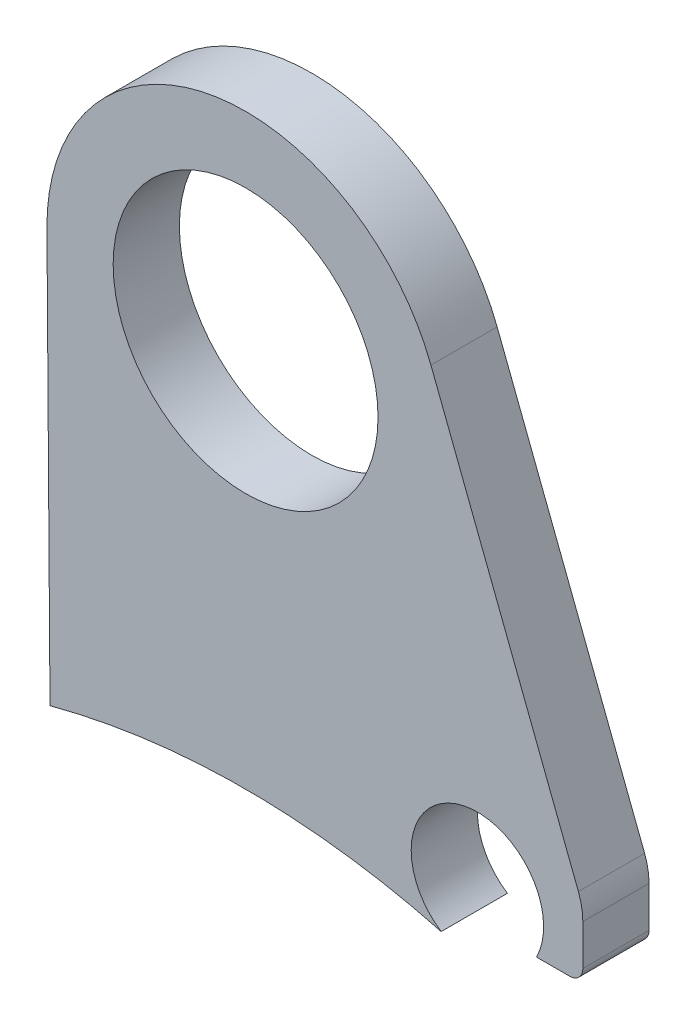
ISO-10303-21;
HEADER;
FILE_DESCRIPTION(('STEP AP214'),'2;1');
FILE_NAME('part.step','',(''),(''),'','','');
FILE_SCHEMA(('AUTOMOTIVE_DESIGN { 1 0 10303 214 1 1 1 1 }'));
ENDSEC;
DATA;
#1=APPLICATION_CONTEXT('core data for automotive mechanical design processes');
#2=APPLICATION_PROTOCOL_DEFINITION('international standard','automotive_design',2000,#1);
#3=PRODUCT_CONTEXT('',#1,'mechanical');
#4=PRODUCT('Part','Part','',(#3));
#5=PRODUCT_RELATED_PRODUCT_CATEGORY('part','',(#4));
#6=PRODUCT_DEFINITION_FORMATION('','',#4);
#7=PRODUCT_DEFINITION_CONTEXT('part definition',#1,'design');
#8=PRODUCT_DEFINITION('design','',#6,#7);
#9=PRODUCT_DEFINITION_SHAPE('','',#8);
#10=(LENGTH_UNIT() NAMED_UNIT(*) SI_UNIT(.MILLI.,.METRE.));
#11=(NAMED_UNIT(*) PLANE_ANGLE_UNIT() SI_UNIT($,.RADIAN.));
#12=(NAMED_UNIT(*) SI_UNIT($,.STERADIAN.) SOLID_ANGLE_UNIT());
#13=UNCERTAINTY_MEASURE_WITH_UNIT(LENGTH_MEASURE(1.E-05),#10,'distance_accuracy_value','');
#14=(GEOMETRIC_REPRESENTATION_CONTEXT(3) GLOBAL_UNCERTAINTY_ASSIGNED_CONTEXT((#13)) GLOBAL_UNIT_ASSIGNED_CONTEXT((#10,
#11,#12)) REPRESENTATION_CONTEXT('',''));
#15=CARTESIAN_POINT('',(0.,0.,0.));
#16=DIRECTION('',(0.,0.,1.));
#17=DIRECTION('',(1.,0.,0.));
#18=AXIS2_PLACEMENT_3D('',#15,#16,#17);
#19=CARTESIAN_POINT('',(2.61766075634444,3.42838590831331,1.));
#20=DIRECTION('',(0.,0.,1.));
#21=DIRECTION('',(1.,0.,0.));
#22=AXIS2_PLACEMENT_3D('',#19,#20,#21);
#23=PLANE('',#22);
#24=DIRECTION('',(1.,0.,0.));
#25=VECTOR('',#24,1.);
#26=CARTESIAN_POINT('',(7.01057399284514,-2.43678106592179,1.));
#27=LINE('',#26,#25);
#28=CARTESIAN_POINT('',(7.01057399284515,-2.43678106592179,1.));
#29=VERTEX_POINT('',#28);
#30=CARTESIAN_POINT('',(7.51057399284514,-2.43678106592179,1.));
#31=VERTEX_POINT('',#30);
#32=EDGE_CURVE('E189',#29,#31,#27,.T.);
#33=ORIENTED_EDGE('',*,*,#32,.T.);
#34=CARTESIAN_POINT('',(7.51057399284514,-2.23678106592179,1.));
#35=DIRECTION('',(0.,0.,1.));
#36=DIRECTION('',(1.,0.,0.));
#37=AXIS2_PLACEMENT_3D('',#34,#35,#36);
#38=CIRCLE('',#37,0.2);
#39=CARTESIAN_POINT('',(7.71057399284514,-2.23678106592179,1.));
#40=VERTEX_POINT('',#39);
#41=EDGE_CURVE('E11',#31,#40,#38,.T.);
#42=ORIENTED_EDGE('',*,*,#41,.T.);
#43=DIRECTION('',(0.,1.,0.));
#44=VECTOR('',#43,1.);
#45=CARTESIAN_POINT('',(7.71057399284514,-2.43678106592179,1.));
#46=LINE('',#45,#44);
#47=CARTESIAN_POINT('',(7.71057399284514,-1.62302345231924,1.));
#48=VERTEX_POINT('',#47);
#49=EDGE_CURVE('E152',#40,#48,#46,.T.);
#50=ORIENTED_EDGE('',*,*,#49,.T.);
#51=CARTESIAN_POINT('',(6.71057399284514,-1.62302345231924,1.));
#52=DIRECTION('',(0.,0.,1.));
#53=DIRECTION('',(1.,0.,0.));
#54=AXIS2_PLACEMENT_3D('',#51,#52,#53);
#55=CIRCLE('',#54,1.);
#56=CARTESIAN_POINT('',(7.64352714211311,-1.2630256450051,1.));
#57=VERTEX_POINT('',#56);
#58=EDGE_CURVE('E142',#48,#57,#55,.T.);
#59=ORIENTED_EDGE('',*,*,#58,.T.);
#60=DIRECTION('',(-0.359997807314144,0.932953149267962,0.));
#61=VECTOR('',#60,1.);
#62=CARTESIAN_POINT('',(7.71057399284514,-1.43678106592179,1.));
#63=LINE('',#62,#61);
#64=CARTESIAN_POINT('',(5.41652020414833,4.50837933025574,1.));
#65=VERTEX_POINT('',#64);
#66=EDGE_CURVE('E119',#57,#65,#63,.T.);
#67=ORIENTED_EDGE('',*,*,#66,.T.);
#68=CARTESIAN_POINT('',(2.61766075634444,3.42838590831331,1.));
#69=DIRECTION('',(0.,0.,1.));
#70=DIRECTION('',(1.,0.,0.));
#71=AXIS2_PLACEMENT_3D('',#68,#69,#70);
#72=CIRCLE('',#71,3.);
#73=CARTESIAN_POINT('',(-0.382256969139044,3.40616789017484,1.));
#74=VERTEX_POINT('',#73);
#75=EDGE_CURVE('E114',#65,#74,#72,.T.);
#76=ORIENTED_EDGE('',*,*,#75,.T.);
#77=DIRECTION('',(0.00740600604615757,-0.999972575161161,0.));
#78=VECTOR('',#77,1.);
#79=CARTESIAN_POINT('',(-0.382256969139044,3.40616789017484,1.));
#80=LINE('',#79,#78);
#81=CARTESIAN_POINT('',(-0.336125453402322,-2.82259431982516,1.));
#82=VERTEX_POINT('',#81);
#83=EDGE_CURVE('E103',#74,#82,#80,.T.);
#84=ORIENTED_EDGE('',*,*,#83,.T.);
#85=CARTESIAN_POINT('',(2.61766075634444,-13.9367810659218,1.));
#86=DIRECTION('',(0.,0.,-1.));
#87=DIRECTION('',(-1.,0.,0.));
#88=AXIS2_PLACEMENT_3D('',#85,#86,#87);
#89=CIRCLE('',#88,11.5);
#90=CARTESIAN_POINT('',(5.57144696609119,-2.82259431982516,1.));
#91=VERTEX_POINT('',#90);
#92=EDGE_CURVE('E113',#82,#91,#89,.T.);
#93=ORIENTED_EDGE('',*,*,#92,.T.);
#94=CARTESIAN_POINT('',(6.11826997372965,-1.9853460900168,1.));
#95=DIRECTION('',(0.,0.,-1.));
#96=DIRECTION('',(-1.,0.,0.));
#97=AXIS2_PLACEMENT_3D('',#94,#95,#96);
#98=CIRCLE('',#97,1.);
#99=EDGE_CURVE('E177',#91,#29,#98,.T.);
#100=ORIENTED_EDGE('',*,*,#99,.T.);
#101=EDGE_LOOP('',(#33,#42,#50,#59,#67,#76,#84,#93,#100));
#102=FACE_BOUND('',#101,.T.);
#103=CARTESIAN_POINT('',(2.61766075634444,3.42838590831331,1.));
#104=DIRECTION('',(0.,0.,1.));
#105=DIRECTION('',(1.,0.,0.));
#106=AXIS2_PLACEMENT_3D('',#103,#104,#105);
#107=CIRCLE('',#106,2.);
#108=CARTESIAN_POINT('',(4.61766075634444,3.42838590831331,1.));
#109=VERTEX_POINT('',#108);
#110=EDGE_CURVE('E186',#109,#109,#107,.T.);
#111=ORIENTED_EDGE('',*,*,#110,.F.);
#112=EDGE_LOOP('',(#111));
#113=FACE_BOUND('',#112,.T.);
#114=ADVANCED_FACE('F32',(#102,#113),#23,.T.);
#115=CARTESIAN_POINT('',(2.61766075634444,3.42838590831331,0.));
#116=DIRECTION('',(0.,0.,1.));
#117=DIRECTION('',(1.,0.,0.));
#118=AXIS2_PLACEMENT_3D('',#115,#116,#117);
#119=PLANE('',#118);
#120=DIRECTION('',(0.,1.,0.));
#121=VECTOR('',#120,1.);
#122=CARTESIAN_POINT('',(7.71057399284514,-2.43678106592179,0.));
#123=LINE('',#122,#121);
#124=CARTESIAN_POINT('',(7.71057399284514,-2.23678106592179,0.));
#125=VERTEX_POINT('',#124);
#126=CARTESIAN_POINT('',(7.71057399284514,-1.62302345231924,0.));
#127=VERTEX_POINT('',#126);
#128=EDGE_CURVE('E151',#125,#127,#123,.T.);
#129=ORIENTED_EDGE('',*,*,#128,.F.);
#130=CARTESIAN_POINT('',(7.51057399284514,-2.23678106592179,0.));
#131=DIRECTION('',(0.,0.,1.));
#132=DIRECTION('',(1.,0.,0.));
#133=AXIS2_PLACEMENT_3D('',#130,#131,#132);
#134=CIRCLE('',#133,0.2);
#135=CARTESIAN_POINT('',(7.51057399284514,-2.43678106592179,0.));
#136=VERTEX_POINT('',#135);
#137=EDGE_CURVE('E54',#125,#136,#134,.F.);
#138=ORIENTED_EDGE('',*,*,#137,.T.);
#139=DIRECTION('',(1.,0.,0.));
#140=VECTOR('',#139,1.);
#141=CARTESIAN_POINT('',(7.01057399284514,-2.43678106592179,0.));
#142=LINE('',#141,#140);
#143=CARTESIAN_POINT('',(7.01057399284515,-2.43678106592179,0.));
#144=VERTEX_POINT('',#143);
#145=EDGE_CURVE('E159',#144,#136,#142,.T.);
#146=ORIENTED_EDGE('',*,*,#145,.F.);
#147=CARTESIAN_POINT('',(6.11826997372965,-1.9853460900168,0.));
#148=DIRECTION('',(0.,0.,-1.));
#149=DIRECTION('',(-1.,0.,0.));
#150=AXIS2_PLACEMENT_3D('',#147,#148,#149);
#151=CIRCLE('',#150,1.);
#152=CARTESIAN_POINT('',(5.57144696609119,-2.82259431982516,0.));
#153=VERTEX_POINT('',#152);
#154=EDGE_CURVE('E162',#153,#144,#151,.T.);
#155=ORIENTED_EDGE('',*,*,#154,.F.);
#156=CARTESIAN_POINT('',(2.61766075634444,-13.9367810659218,0.));
#157=DIRECTION('',(0.,0.,-1.));
#158=DIRECTION('',(-1.,0.,0.));
#159=AXIS2_PLACEMENT_3D('',#156,#157,#158);
#160=CIRCLE('',#159,11.5);
#161=CARTESIAN_POINT('',(-0.336125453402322,-2.82259431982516,0.));
#162=VERTEX_POINT('',#161);
#163=EDGE_CURVE('E180',#162,#153,#160,.T.);
#164=ORIENTED_EDGE('',*,*,#163,.F.);
#165=DIRECTION('',(0.00740600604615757,-0.999972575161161,0.));
#166=VECTOR('',#165,1.);
#167=CARTESIAN_POINT('',(-0.382256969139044,3.40616789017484,0.));
#168=LINE('',#167,#166);
#169=CARTESIAN_POINT('',(-0.382256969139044,3.40616789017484,0.));
#170=VERTEX_POINT('',#169);
#171=EDGE_CURVE('E181',#170,#162,#168,.T.);
#172=ORIENTED_EDGE('',*,*,#171,.F.);
#173=CARTESIAN_POINT('',(2.61766075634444,3.42838590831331,0.));
#174=DIRECTION('',(0.,0.,1.));
#175=DIRECTION('',(1.,0.,0.));
#176=AXIS2_PLACEMENT_3D('',#173,#174,#175);
#177=CIRCLE('',#176,3.);
#178=CARTESIAN_POINT('',(5.41652020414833,4.50837933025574,0.));
#179=VERTEX_POINT('',#178);
#180=EDGE_CURVE('E127',#179,#170,#177,.T.);
#181=ORIENTED_EDGE('',*,*,#180,.F.);
#182=DIRECTION('',(-0.359997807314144,0.932953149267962,0.));
#183=VECTOR('',#182,1.);
#184=CARTESIAN_POINT('',(7.71057399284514,-1.43678106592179,0.));
#185=LINE('',#184,#183);
#186=CARTESIAN_POINT('',(7.64352714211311,-1.2630256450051,0.));
#187=VERTEX_POINT('',#186);
#188=EDGE_CURVE('E123',#187,#179,#185,.T.);
#189=ORIENTED_EDGE('',*,*,#188,.F.);
#190=CARTESIAN_POINT('',(6.71057399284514,-1.62302345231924,0.));
#191=DIRECTION('',(0.,0.,1.));
#192=DIRECTION('',(1.,0.,0.));
#193=AXIS2_PLACEMENT_3D('',#190,#191,#192);
#194=CIRCLE('',#193,1.);
#195=EDGE_CURVE('E131',#187,#127,#194,.F.);
#196=ORIENTED_EDGE('',*,*,#195,.T.);
#197=EDGE_LOOP('',(#129,#138,#146,#155,#164,#172,#181,#189,#196));
#198=FACE_BOUND('',#197,.T.);
#199=CARTESIAN_POINT('',(2.61766075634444,3.42838590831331,0.));
#200=DIRECTION('',(0.,0.,1.));
#201=DIRECTION('',(1.,0.,0.));
#202=AXIS2_PLACEMENT_3D('',#199,#200,#201);
#203=CIRCLE('',#202,2.);
#204=CARTESIAN_POINT('',(4.61766075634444,3.42838590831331,0.));
#205=VERTEX_POINT('',#204);
#206=EDGE_CURVE('E193',#205,#205,#203,.T.);
#207=ORIENTED_EDGE('',*,*,#206,.T.);
#208=EDGE_LOOP('',(#207));
#209=FACE_BOUND('',#208,.T.);
#210=ADVANCED_FACE('F155',(#198,#209),#119,.F.);
#211=CARTESIAN_POINT('',(2.61766075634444,3.42838590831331,1.));
#212=DIRECTION('',(0.,0.,-1.));
#213=DIRECTION('',(-1.,0.,0.));
#214=AXIS2_PLACEMENT_3D('',#211,#212,#213);
#215=CYLINDRICAL_SURFACE('',#214,3.);
#216=ORIENTED_EDGE('',*,*,#180,.T.);
#217=DIRECTION('',(0.,0.,-1.));
#218=VECTOR('',#217,1.);
#219=CARTESIAN_POINT('',(-0.382256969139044,3.40616789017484,1.));
#220=LINE('',#219,#218);
#221=EDGE_CURVE('E107',#74,#170,#220,.T.);
#222=ORIENTED_EDGE('',*,*,#221,.F.);
#223=ORIENTED_EDGE('',*,*,#75,.F.);
#224=DIRECTION('',(0.,0.,-1.));
#225=VECTOR('',#224,1.);
#226=CARTESIAN_POINT('',(5.41652020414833,4.50837933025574,1.));
#227=LINE('',#226,#225);
#228=EDGE_CURVE('E166',#65,#179,#227,.T.);
#229=ORIENTED_EDGE('',*,*,#228,.T.);
#230=EDGE_LOOP('',(#216,#222,#223,#229));
#231=FACE_BOUND('',#230,.T.);
#232=ADVANCED_FACE('F125',(#231),#215,.T.);
#233=CARTESIAN_POINT('',(-0.382256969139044,3.40616789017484,1.));
#234=DIRECTION('',(0.999972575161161,0.00740600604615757,0.));
#235=DIRECTION('',(-0.00740600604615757,0.999972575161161,0.));
#236=AXIS2_PLACEMENT_3D('',#233,#234,#235);
#237=PLANE('',#236);
#238=ORIENTED_EDGE('',*,*,#171,.T.);
#239=DIRECTION('',(0.,0.,-1.));
#240=VECTOR('',#239,1.);
#241=CARTESIAN_POINT('',(-0.336125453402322,-2.82259431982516,1.));
#242=LINE('',#241,#240);
#243=EDGE_CURVE('E110',#82,#162,#242,.T.);
#244=ORIENTED_EDGE('',*,*,#243,.F.);
#245=ORIENTED_EDGE('',*,*,#83,.F.);
#246=ORIENTED_EDGE('',*,*,#221,.T.);
#247=EDGE_LOOP('',(#238,#244,#245,#246));
#248=FACE_BOUND('',#247,.T.);
#249=ADVANCED_FACE('F105',(#248),#237,.F.);
#250=CARTESIAN_POINT('',(2.61766075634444,-13.9367810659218,1.));
#251=DIRECTION('',(0.,0.,-1.));
#252=DIRECTION('',(-1.,0.,0.));
#253=AXIS2_PLACEMENT_3D('',#250,#251,#252);
#254=CYLINDRICAL_SURFACE('',#253,11.5);
#255=ORIENTED_EDGE('',*,*,#163,.T.);
#256=DIRECTION('',(0.,0.,-1.));
#257=VECTOR('',#256,1.);
#258=CARTESIAN_POINT('',(5.57144696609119,-2.82259431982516,1.));
#259=LINE('',#258,#257);
#260=EDGE_CURVE('E133',#91,#153,#259,.T.);
#261=ORIENTED_EDGE('',*,*,#260,.F.);
#262=ORIENTED_EDGE('',*,*,#92,.F.);
#263=ORIENTED_EDGE('',*,*,#243,.T.);
#264=EDGE_LOOP('',(#255,#261,#262,#263));
#265=FACE_BOUND('',#264,.T.);
#266=ADVANCED_FACE('F220',(#265),#254,.F.);
#267=CARTESIAN_POINT('',(6.11826997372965,-1.9853460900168,1.));
#268=DIRECTION('',(0.,0.,-1.));
#269=DIRECTION('',(-1.,0.,0.));
#270=AXIS2_PLACEMENT_3D('',#267,#268,#269);
#271=CYLINDRICAL_SURFACE('',#270,1.);
#272=ORIENTED_EDGE('',*,*,#154,.T.);
#273=DIRECTION('',(0.,0.,-1.));
#274=VECTOR('',#273,1.);
#275=CARTESIAN_POINT('',(7.01057399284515,-2.43678106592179,1.));
#276=LINE('',#275,#274);
#277=EDGE_CURVE('E168',#29,#144,#276,.T.);
#278=ORIENTED_EDGE('',*,*,#277,.F.);
#279=ORIENTED_EDGE('',*,*,#99,.F.);
#280=ORIENTED_EDGE('',*,*,#260,.T.);
#281=EDGE_LOOP('',(#272,#278,#279,#280));
#282=FACE_BOUND('',#281,.T.);
#283=ADVANCED_FACE('F175',(#282),#271,.F.);
#284=CARTESIAN_POINT('',(7.01057399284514,-2.43678106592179,1.));
#285=DIRECTION('',(0.,1.,0.));
#286=DIRECTION('',(0.,0.,1.));
#287=AXIS2_PLACEMENT_3D('',#284,#285,#286);
#288=PLANE('',#287);
#289=ORIENTED_EDGE('',*,*,#145,.T.);
#290=DIRECTION('',(0.,0.,-1.));
#291=VECTOR('',#290,1.);
#292=CARTESIAN_POINT('',(7.51057399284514,-2.43678106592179,1.));
#293=LINE('',#292,#291);
#294=EDGE_CURVE('E40',#136,#31,#293,.F.);
#295=ORIENTED_EDGE('',*,*,#294,.T.);
#296=ORIENTED_EDGE('',*,*,#32,.F.);
#297=ORIENTED_EDGE('',*,*,#277,.T.);
#298=EDGE_LOOP('',(#289,#295,#296,#297));
#299=FACE_BOUND('',#298,.T.);
#300=ADVANCED_FACE('F215',(#299),#288,.F.);
#301=CARTESIAN_POINT('',(7.71057399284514,-2.43678106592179,1.));
#302=DIRECTION('',(-1.,0.,0.));
#303=DIRECTION('',(0.,0.,1.));
#304=AXIS2_PLACEMENT_3D('',#301,#302,#303);
#305=PLANE('',#304);
#306=ORIENTED_EDGE('',*,*,#49,.F.);
#307=DIRECTION('',(0.,0.,-1.));
#308=VECTOR('',#307,1.);
#309=CARTESIAN_POINT('',(7.71057399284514,-2.23678106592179,1.));
#310=LINE('',#309,#308);
#311=EDGE_CURVE('E144',#40,#125,#310,.T.);
#312=ORIENTED_EDGE('',*,*,#311,.T.);
#313=ORIENTED_EDGE('',*,*,#128,.T.);
#314=DIRECTION('',(0.,0.,-1.));
#315=VECTOR('',#314,1.);
#316=CARTESIAN_POINT('',(7.71057399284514,-1.62302345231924,1.));
#317=LINE('',#316,#315);
#318=EDGE_CURVE('E139',#127,#48,#317,.F.);
#319=ORIENTED_EDGE('',*,*,#318,.T.);
#320=EDGE_LOOP('',(#306,#312,#313,#319));
#321=FACE_BOUND('',#320,.T.);
#322=ADVANCED_FACE('F150',(#321),#305,.F.);
#323=CARTESIAN_POINT('',(7.71057399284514,-1.43678106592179,1.));
#324=DIRECTION('',(-0.932953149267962,-0.359997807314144,0.));
#325=DIRECTION('',(0.359997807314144,-0.932953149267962,0.));
#326=AXIS2_PLACEMENT_3D('',#323,#324,#325);
#327=PLANE('',#326);
#328=ORIENTED_EDGE('',*,*,#66,.F.);
#329=DIRECTION('',(0.,0.,-1.));
#330=VECTOR('',#329,1.);
#331=CARTESIAN_POINT('',(7.64352714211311,-1.2630256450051,1.));
#332=LINE('',#331,#330);
#333=EDGE_CURVE('E128',#57,#187,#332,.T.);
#334=ORIENTED_EDGE('',*,*,#333,.T.);
#335=ORIENTED_EDGE('',*,*,#188,.T.);
#336=ORIENTED_EDGE('',*,*,#228,.F.);
#337=EDGE_LOOP('',(#328,#334,#335,#336));
#338=FACE_BOUND('',#337,.T.);
#339=ADVANCED_FACE('F209',(#338),#327,.F.);
#340=CARTESIAN_POINT('',(2.61766075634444,3.42838590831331,1.));
#341=DIRECTION('',(0.,0.,-1.));
#342=DIRECTION('',(-1.,0.,0.));
#343=AXIS2_PLACEMENT_3D('',#340,#341,#342);
#344=CYLINDRICAL_SURFACE('',#343,2.);
#345=ORIENTED_EDGE('',*,*,#110,.T.);
#346=EDGE_LOOP('',(#345));
#347=FACE_BOUND('',#346,.T.);
#348=ORIENTED_EDGE('',*,*,#206,.F.);
#349=EDGE_LOOP('',(#348));
#350=FACE_BOUND('',#349,.T.);
#351=ADVANCED_FACE('F199',(#347,#350),#344,.F.);
#352=CARTESIAN_POINT('',(6.71057399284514,-1.62302345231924,1.));
#353=DIRECTION('',(0.,0.,-1.));
#354=DIRECTION('',(-1.,0.,0.));
#355=AXIS2_PLACEMENT_3D('',#352,#353,#354);
#356=CYLINDRICAL_SURFACE('',#355,1.);
#357=ORIENTED_EDGE('',*,*,#58,.F.);
#358=ORIENTED_EDGE('',*,*,#318,.F.);
#359=ORIENTED_EDGE('',*,*,#195,.F.);
#360=ORIENTED_EDGE('',*,*,#333,.F.);
#361=EDGE_LOOP('',(#357,#358,#359,#360));
#362=FACE_BOUND('',#361,.T.);
#363=ADVANCED_FACE('F226',(#362),#356,.T.);
#364=CARTESIAN_POINT('',(7.51057399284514,-2.23678106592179,1.));
#365=DIRECTION('',(0.,0.,-1.));
#366=DIRECTION('',(-1.,0.,0.));
#367=AXIS2_PLACEMENT_3D('',#364,#365,#366);
#368=CYLINDRICAL_SURFACE('',#367,0.2);
#369=ORIENTED_EDGE('',*,*,#41,.F.);
#370=ORIENTED_EDGE('',*,*,#294,.F.);
#371=ORIENTED_EDGE('',*,*,#137,.F.);
#372=ORIENTED_EDGE('',*,*,#311,.F.);
#373=EDGE_LOOP('',(#369,#370,#371,#372));
#374=FACE_BOUND('',#373,.T.);
#375=ADVANCED_FACE('F34',(#374),#368,.T.);
#376=CLOSED_SHELL('',(#114,#210,#232,#249,#266,#283,#300,#322,#339,#351,#363,#375));
#377=MANIFOLD_SOLID_BREP('B2',#376);
#378=ADVANCED_BREP_SHAPE_REPRESENTATION('',(#18,#377),#14);
#379=SHAPE_DEFINITION_REPRESENTATION(#9,#378);
ENDSEC;
END-ISO-10303-21;
